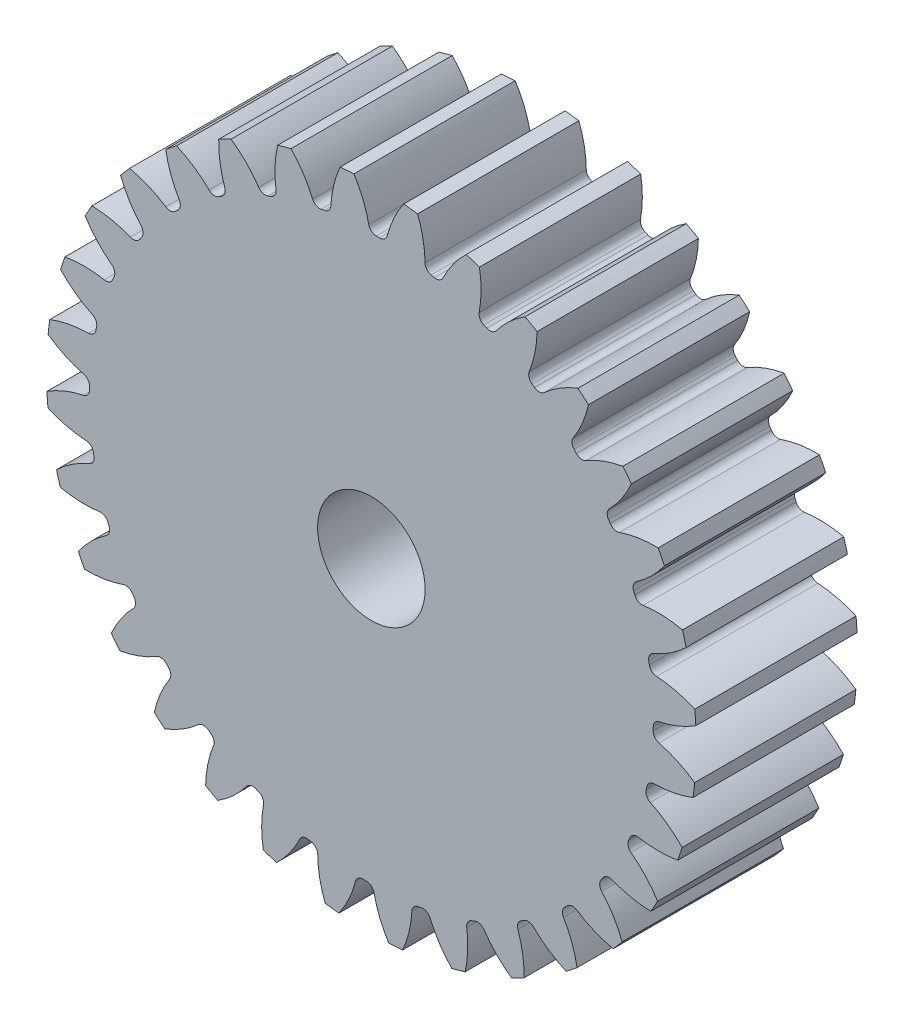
from build123d import *

# Parameters (mm, degrees)
SKETCH3_R         = 191.911111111
GEARBODY_DEPTH    = 95.25
TOOTHCUT_DEPTH    = 288.632250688
CIRPATTERN1_COUNT = 32
BOREDIA_R         = 31.75
BORE_DEPTH        = 12700


with BuildPart() as part:
    # Sketch3 → gearBody (new body)
    with BuildSketch(Plane.XY):
        Circle(SKETCH3_R)
    extrude(amount=GEARBODY_DEPTH)

    # Sketch2 → toothCut (cut, through all)
    with BuildSketch(Plane.XY):
        with BuildLine():
            ThreePointArc((166.441430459, -4.816674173), (166.466593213, -3.850125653), (166.486143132, -2.883447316))
            ThreePointArc((166.486143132, -2.883447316), (167.537952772, -0.036610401), (170.135243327, 1.533378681))
            ThreePointArc((170.135243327, 1.533378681), (181.432762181, 5.008726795), (191.911111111, 10.478295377))
            ThreePointArc((191.911111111, 10.478295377), (192.145569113, -4.444042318), (191.221467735, -19.339584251))
            ThreePointArc((191.221467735, -19.339584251), (181.007193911, -13.391425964), (169.882428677, -9.397483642))
            ThreePointArc((169.882428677, -9.397483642), (167.360499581, -7.709094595), (166.441430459, -4.816674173))
        make_face()
    toothcut = extrude(amount=TOOTHCUT_DEPTH, mode=Mode.SUBTRACT)

    # CirPattern1: toothCut ×32 about axis
    cirpattern1_axis = Axis((0, 0, 0), (0, 0, 1))
    for i in range(1, CIRPATTERN1_COUNT):
        add(toothcut.rotate(cirpattern1_axis, i * 360 / CIRPATTERN1_COUNT), mode=Mode.SUBTRACT)

    # boreDia → bore (cut, symmetric)
    with BuildSketch(Plane.XY):
        Circle(BOREDIA_R)
    extrude(amount=BORE_DEPTH, both=True, mode=Mode.SUBTRACT)


solid = part.part
